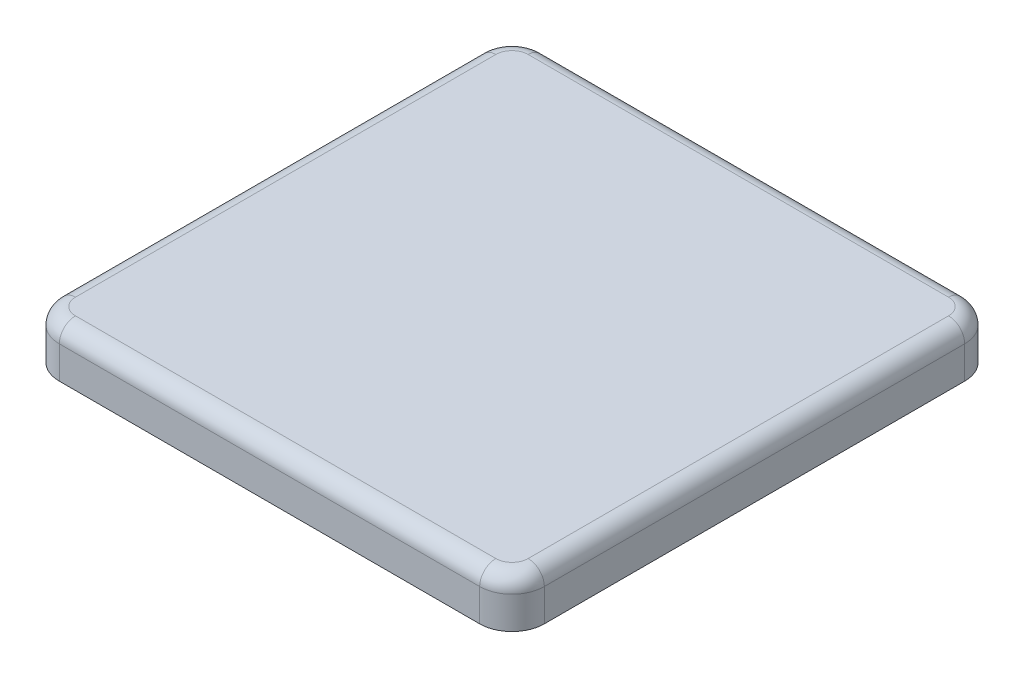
ISO-10303-21;
HEADER;
FILE_DESCRIPTION(('STEP AP214'),'2;1');
FILE_NAME('part.step','',(''),(''),'','','');
FILE_SCHEMA(('AUTOMOTIVE_DESIGN { 1 0 10303 214 1 1 1 1 }'));
ENDSEC;
DATA;
#1=APPLICATION_CONTEXT('core data for automotive mechanical design processes');
#2=APPLICATION_PROTOCOL_DEFINITION('international standard','automotive_design',2000,#1);
#3=PRODUCT_CONTEXT('',#1,'mechanical');
#4=PRODUCT('Part','Part','',(#3));
#5=PRODUCT_RELATED_PRODUCT_CATEGORY('part','',(#4));
#6=PRODUCT_DEFINITION_FORMATION('','',#4);
#7=PRODUCT_DEFINITION_CONTEXT('part definition',#1,'design');
#8=PRODUCT_DEFINITION('design','',#6,#7);
#9=PRODUCT_DEFINITION_SHAPE('','',#8);
#10=(LENGTH_UNIT() NAMED_UNIT(*) SI_UNIT(.MILLI.,.METRE.));
#11=(NAMED_UNIT(*) PLANE_ANGLE_UNIT() SI_UNIT($,.RADIAN.));
#12=(NAMED_UNIT(*) SI_UNIT($,.STERADIAN.) SOLID_ANGLE_UNIT());
#13=UNCERTAINTY_MEASURE_WITH_UNIT(LENGTH_MEASURE(1.E-05),#10,'distance_accuracy_value','');
#14=(GEOMETRIC_REPRESENTATION_CONTEXT(3) GLOBAL_UNCERTAINTY_ASSIGNED_CONTEXT((#13)) GLOBAL_UNIT_ASSIGNED_CONTEXT((#10,
#11,#12)) REPRESENTATION_CONTEXT('',''));
#15=CARTESIAN_POINT('',(0.,0.,0.));
#16=DIRECTION('',(0.,0.,1.));
#17=DIRECTION('',(1.,0.,0.));
#18=AXIS2_PLACEMENT_3D('',#15,#16,#17);
#19=CARTESIAN_POINT('',(-13.,-0.5,13.));
#20=DIRECTION('',(0.,-1.,0.));
#21=DIRECTION('',(0.,0.,-1.));
#22=AXIS2_PLACEMENT_3D('',#19,#20,#21);
#23=PLANE('',#22);
#24=DIRECTION('',(0.,0.,1.));
#25=VECTOR('',#24,1.);
#26=CARTESIAN_POINT('',(-12.1,-0.5,3.));
#27=LINE('',#26,#25);
#28=CARTESIAN_POINT('',(-12.1,-0.5,-3.));
#29=VERTEX_POINT('',#28);
#30=CARTESIAN_POINT('',(-12.1,-0.5,3.));
#31=VERTEX_POINT('',#30);
#32=EDGE_CURVE('E251',#29,#31,#27,.T.);
#33=ORIENTED_EDGE('',*,*,#32,.F.);
#34=DIRECTION('',(-1.,0.,0.));
#35=VECTOR('',#34,1.);
#36=CARTESIAN_POINT('',(-13.,-0.5,-3.));
#37=LINE('',#36,#35);
#38=CARTESIAN_POINT('',(-13.2,-0.5,-3.));
#39=VERTEX_POINT('',#38);
#40=EDGE_CURVE('E449',#29,#39,#37,.T.);
#41=ORIENTED_EDGE('',*,*,#40,.T.);
#42=DIRECTION('',(0.,0.,-1.));
#43=VECTOR('',#42,1.);
#44=CARTESIAN_POINT('',(-13.2,-0.5,13.));
#45=LINE('',#44,#43);
#46=CARTESIAN_POINT('',(-13.2,-0.5,-13.));
#47=VERTEX_POINT('',#46);
#48=EDGE_CURVE('E310',#39,#47,#45,.T.);
#49=ORIENTED_EDGE('',*,*,#48,.T.);
#50=CARTESIAN_POINT('',(-13.,-0.5,-13.));
#51=DIRECTION('',(0.,-1.,0.));
#52=DIRECTION('',(0.,0.,-1.));
#53=AXIS2_PLACEMENT_3D('',#50,#51,#52);
#54=CIRCLE('',#53,0.200000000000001);
#55=CARTESIAN_POINT('',(-13.,-0.5,-13.2));
#56=VERTEX_POINT('',#55);
#57=EDGE_CURVE('E315',#47,#56,#54,.T.);
#58=ORIENTED_EDGE('',*,*,#57,.T.);
#59=DIRECTION('',(1.,0.,0.));
#60=VECTOR('',#59,1.);
#61=CARTESIAN_POINT('',(-13.,-0.5,-13.2));
#62=LINE('',#61,#60);
#63=CARTESIAN_POINT('',(13.,-0.5,-13.2));
#64=VERTEX_POINT('',#63);
#65=EDGE_CURVE('E318',#56,#64,#62,.T.);
#66=ORIENTED_EDGE('',*,*,#65,.T.);
#67=CARTESIAN_POINT('',(13.,-0.5,-13.));
#68=DIRECTION('',(0.,-1.,0.));
#69=DIRECTION('',(0.,0.,-1.));
#70=AXIS2_PLACEMENT_3D('',#67,#68,#69);
#71=CIRCLE('',#70,0.200000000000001);
#72=CARTESIAN_POINT('',(13.2,-0.5,-13.));
#73=VERTEX_POINT('',#72);
#74=EDGE_CURVE('E321',#64,#73,#71,.T.);
#75=ORIENTED_EDGE('',*,*,#74,.T.);
#76=DIRECTION('',(0.,0.,1.));
#77=VECTOR('',#76,1.);
#78=CARTESIAN_POINT('',(13.2,-0.5,13.));
#79=LINE('',#78,#77);
#80=CARTESIAN_POINT('',(13.2,-0.5,13.));
#81=VERTEX_POINT('',#80);
#82=EDGE_CURVE('E324',#73,#81,#79,.T.);
#83=ORIENTED_EDGE('',*,*,#82,.T.);
#84=CARTESIAN_POINT('',(13.,-0.5,13.));
#85=DIRECTION('',(0.,-1.,0.));
#86=DIRECTION('',(0.,0.,-1.));
#87=AXIS2_PLACEMENT_3D('',#84,#85,#86);
#88=CIRCLE('',#87,0.200000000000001);
#89=CARTESIAN_POINT('',(13.,-0.5,13.2));
#90=VERTEX_POINT('',#89);
#91=EDGE_CURVE('E327',#81,#90,#88,.T.);
#92=ORIENTED_EDGE('',*,*,#91,.T.);
#93=DIRECTION('',(-1.,0.,0.));
#94=VECTOR('',#93,1.);
#95=CARTESIAN_POINT('',(-13.,-0.5,13.2));
#96=LINE('',#95,#94);
#97=CARTESIAN_POINT('',(-13.,-0.5,13.2));
#98=VERTEX_POINT('',#97);
#99=EDGE_CURVE('E330',#90,#98,#96,.T.);
#100=ORIENTED_EDGE('',*,*,#99,.T.);
#101=CARTESIAN_POINT('',(-13.,-0.5,13.));
#102=DIRECTION('',(0.,-1.,0.));
#103=DIRECTION('',(0.,0.,-1.));
#104=AXIS2_PLACEMENT_3D('',#101,#102,#103);
#105=CIRCLE('',#104,0.200000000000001);
#106=CARTESIAN_POINT('',(-13.2,-0.5,13.));
#107=VERTEX_POINT('',#106);
#108=EDGE_CURVE('E307',#98,#107,#105,.T.);
#109=ORIENTED_EDGE('',*,*,#108,.T.);
#110=CARTESIAN_POINT('',(-13.2,-0.5,3.));
#111=VERTEX_POINT('',#110);
#112=EDGE_CURVE('E312',#107,#111,#45,.T.);
#113=ORIENTED_EDGE('',*,*,#112,.T.);
#114=DIRECTION('',(-1.,0.,0.));
#115=VECTOR('',#114,1.);
#116=CARTESIAN_POINT('',(-13.7,-0.5,3.));
#117=LINE('',#116,#115);
#118=EDGE_CURVE('E278',#31,#111,#117,.T.);
#119=ORIENTED_EDGE('',*,*,#118,.F.);
#120=EDGE_LOOP('',(#33,#41,#49,#58,#66,#75,#83,#92,#100,#109,#113,#119));
#121=FACE_BOUND('',#120,.T.);
#122=DIRECTION('',(1.,0.,0.));
#123=VECTOR('',#122,1.);
#124=CARTESIAN_POINT('',(-1.65,-0.5,-2.45));
#125=LINE('',#124,#123);
#126=CARTESIAN_POINT('',(-1.65,-0.5,-2.45));
#127=VERTEX_POINT('',#126);
#128=CARTESIAN_POINT('',(1.65,-0.5,-2.45));
#129=VERTEX_POINT('',#128);
#130=EDGE_CURVE('E247',#127,#129,#125,.T.);
#131=ORIENTED_EDGE('',*,*,#130,.F.);
#132=DIRECTION('',(0.,0.,-1.));
#133=VECTOR('',#132,1.);
#134=CARTESIAN_POINT('',(-1.65,-0.5,2.45));
#135=LINE('',#134,#133);
#136=CARTESIAN_POINT('',(-1.65,-0.5,2.45));
#137=VERTEX_POINT('',#136);
#138=EDGE_CURVE('E255',#137,#127,#135,.T.);
#139=ORIENTED_EDGE('',*,*,#138,.F.);
#140=DIRECTION('',(-1.,0.,0.));
#141=VECTOR('',#140,1.);
#142=CARTESIAN_POINT('',(-1.65,-0.5,2.45));
#143=LINE('',#142,#141);
#144=CARTESIAN_POINT('',(1.65,-0.5,2.45));
#145=VERTEX_POINT('',#144);
#146=EDGE_CURVE('E266',#145,#137,#143,.T.);
#147=ORIENTED_EDGE('',*,*,#146,.F.);
#148=DIRECTION('',(0.,0.,1.));
#149=VECTOR('',#148,1.);
#150=CARTESIAN_POINT('',(1.65,-0.5,2.45));
#151=LINE('',#150,#149);
#152=EDGE_CURVE('E264',#129,#145,#151,.T.);
#153=ORIENTED_EDGE('',*,*,#152,.F.);
#154=EDGE_LOOP('',(#131,#139,#147,#153));
#155=FACE_BOUND('',#154,.T.);
#156=ADVANCED_FACE('F35',(#121,#155),#23,.T.);
#157=CARTESIAN_POINT('',(-13.,-1.5,-13.));
#158=DIRECTION('',(0.,1.,0.));
#159=DIRECTION('',(0.,0.,1.));
#160=AXIS2_PLACEMENT_3D('',#157,#158,#159);
#161=PLANE('',#160);
#162=CARTESIAN_POINT('',(-13.,-1.5,-13.));
#163=DIRECTION('',(0.,1.,0.));
#164=DIRECTION('',(0.,0.,1.));
#165=AXIS2_PLACEMENT_3D('',#162,#163,#164);
#166=CIRCLE('',#165,2.);
#167=CARTESIAN_POINT('',(-13.,-1.5,-15.));
#168=VERTEX_POINT('',#167);
#169=CARTESIAN_POINT('',(-15.,-1.5,-13.));
#170=VERTEX_POINT('',#169);
#171=EDGE_CURVE('E374',#168,#170,#166,.T.);
#172=ORIENTED_EDGE('',*,*,#171,.F.);
#173=DIRECTION('',(-1.,0.,0.));
#174=VECTOR('',#173,1.);
#175=CARTESIAN_POINT('',(-13.,-1.5,-15.));
#176=LINE('',#175,#174);
#177=CARTESIAN_POINT('',(13.,-1.5,-15.));
#178=VERTEX_POINT('',#177);
#179=EDGE_CURVE('E396',#178,#168,#176,.T.);
#180=ORIENTED_EDGE('',*,*,#179,.F.);
#181=CARTESIAN_POINT('',(13.,-1.5,-13.));
#182=DIRECTION('',(0.,1.,0.));
#183=DIRECTION('',(0.,0.,1.));
#184=AXIS2_PLACEMENT_3D('',#181,#182,#183);
#185=CIRCLE('',#184,2.);
#186=CARTESIAN_POINT('',(15.,-1.5,-13.));
#187=VERTEX_POINT('',#186);
#188=EDGE_CURVE('E393',#187,#178,#185,.T.);
#189=ORIENTED_EDGE('',*,*,#188,.F.);
#190=DIRECTION('',(0.,0.,-1.));
#191=VECTOR('',#190,1.);
#192=CARTESIAN_POINT('',(15.,-1.5,13.));
#193=LINE('',#192,#191);
#194=CARTESIAN_POINT('',(15.,-1.5,13.));
#195=VERTEX_POINT('',#194);
#196=EDGE_CURVE('E390',#195,#187,#193,.T.);
#197=ORIENTED_EDGE('',*,*,#196,.F.);
#198=CARTESIAN_POINT('',(13.,-1.5,13.));
#199=DIRECTION('',(0.,1.,0.));
#200=DIRECTION('',(0.,0.,1.));
#201=AXIS2_PLACEMENT_3D('',#198,#199,#200);
#202=CIRCLE('',#201,2.);
#203=CARTESIAN_POINT('',(13.,-1.5,15.));
#204=VERTEX_POINT('',#203);
#205=EDGE_CURVE('E387',#204,#195,#202,.T.);
#206=ORIENTED_EDGE('',*,*,#205,.F.);
#207=DIRECTION('',(1.,0.,0.));
#208=VECTOR('',#207,1.);
#209=CARTESIAN_POINT('',(-13.,-1.5,15.));
#210=LINE('',#209,#208);
#211=CARTESIAN_POINT('',(-13.,-1.5,15.));
#212=VERTEX_POINT('',#211);
#213=EDGE_CURVE('E384',#212,#204,#210,.T.);
#214=ORIENTED_EDGE('',*,*,#213,.F.);
#215=CARTESIAN_POINT('',(-13.,-1.5,13.));
#216=DIRECTION('',(0.,1.,0.));
#217=DIRECTION('',(0.,0.,1.));
#218=AXIS2_PLACEMENT_3D('',#215,#216,#217);
#219=CIRCLE('',#218,2.);
#220=CARTESIAN_POINT('',(-15.,-1.5,13.));
#221=VERTEX_POINT('',#220);
#222=EDGE_CURVE('E381',#221,#212,#219,.T.);
#223=ORIENTED_EDGE('',*,*,#222,.F.);
#224=DIRECTION('',(0.,0.,1.));
#225=VECTOR('',#224,1.);
#226=CARTESIAN_POINT('',(-15.,-1.5,13.));
#227=LINE('',#226,#225);
#228=EDGE_CURVE('E377',#170,#221,#227,.T.);
#229=ORIENTED_EDGE('',*,*,#228,.F.);
#230=EDGE_LOOP('',(#172,#180,#189,#197,#206,#214,#223,#229));
#231=FACE_BOUND('',#230,.T.);
#232=DIRECTION('',(1.,0.,0.));
#233=VECTOR('',#232,1.);
#234=CARTESIAN_POINT('',(-13.,-1.5,-3.));
#235=LINE('',#234,#233);
#236=CARTESIAN_POINT('',(-13.7,-1.5,-3.));
#237=VERTEX_POINT('',#236);
#238=CARTESIAN_POINT('',(-13.2,-1.5,-3.));
#239=VERTEX_POINT('',#238);
#240=EDGE_CURVE('E304',#237,#239,#235,.T.);
#241=ORIENTED_EDGE('',*,*,#240,.F.);
#242=DIRECTION('',(0.,0.,-1.));
#243=VECTOR('',#242,1.);
#244=CARTESIAN_POINT('',(-13.7,-1.5,-13.));
#245=LINE('',#244,#243);
#246=CARTESIAN_POINT('',(-13.7,-1.5,3.));
#247=VERTEX_POINT('',#246);
#248=EDGE_CURVE('E472',#247,#237,#245,.T.);
#249=ORIENTED_EDGE('',*,*,#248,.F.);
#250=DIRECTION('',(-1.,0.,0.));
#251=VECTOR('',#250,1.);
#252=CARTESIAN_POINT('',(-13.,-1.5,3.));
#253=LINE('',#252,#251);
#254=CARTESIAN_POINT('',(-13.2,-1.5,3.));
#255=VERTEX_POINT('',#254);
#256=EDGE_CURVE('E300',#255,#247,#253,.T.);
#257=ORIENTED_EDGE('',*,*,#256,.F.);
#258=DIRECTION('',(0.,0.,-1.));
#259=VECTOR('',#258,1.);
#260=CARTESIAN_POINT('',(-13.2,-1.5,13.));
#261=LINE('',#260,#259);
#262=CARTESIAN_POINT('',(-13.2,-1.5,13.));
#263=VERTEX_POINT('',#262);
#264=EDGE_CURVE('E336',#263,#255,#261,.T.);
#265=ORIENTED_EDGE('',*,*,#264,.F.);
#266=CARTESIAN_POINT('',(-13.,-1.5,13.));
#267=DIRECTION('',(0.,-1.,0.));
#268=DIRECTION('',(0.,0.,-1.));
#269=AXIS2_PLACEMENT_3D('',#266,#267,#268);
#270=CIRCLE('',#269,0.200000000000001);
#271=CARTESIAN_POINT('',(-13.,-1.5,13.2));
#272=VERTEX_POINT('',#271);
#273=EDGE_CURVE('E306',#272,#263,#270,.T.);
#274=ORIENTED_EDGE('',*,*,#273,.F.);
#275=DIRECTION('',(-1.,0.,0.));
#276=VECTOR('',#275,1.);
#277=CARTESIAN_POINT('',(-13.,-1.5,13.2));
#278=LINE('',#277,#276);
#279=CARTESIAN_POINT('',(13.,-1.5,13.2));
#280=VERTEX_POINT('',#279);
#281=EDGE_CURVE('E311',#280,#272,#278,.T.);
#282=ORIENTED_EDGE('',*,*,#281,.F.);
#283=CARTESIAN_POINT('',(13.,-1.5,13.));
#284=DIRECTION('',(0.,-1.,0.));
#285=DIRECTION('',(0.,0.,-1.));
#286=AXIS2_PLACEMENT_3D('',#283,#284,#285);
#287=CIRCLE('',#286,0.200000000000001);
#288=CARTESIAN_POINT('',(13.2,-1.5,13.));
#289=VERTEX_POINT('',#288);
#290=EDGE_CURVE('E351',#289,#280,#287,.T.);
#291=ORIENTED_EDGE('',*,*,#290,.F.);
#292=DIRECTION('',(0.,0.,1.));
#293=VECTOR('',#292,1.);
#294=CARTESIAN_POINT('',(13.2,-1.5,13.));
#295=LINE('',#294,#293);
#296=CARTESIAN_POINT('',(13.2,-1.5,-13.));
#297=VERTEX_POINT('',#296);
#298=EDGE_CURVE('E348',#297,#289,#295,.T.);
#299=ORIENTED_EDGE('',*,*,#298,.F.);
#300=CARTESIAN_POINT('',(13.,-1.5,-13.));
#301=DIRECTION('',(0.,-1.,0.));
#302=DIRECTION('',(0.,0.,-1.));
#303=AXIS2_PLACEMENT_3D('',#300,#301,#302);
#304=CIRCLE('',#303,0.200000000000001);
#305=CARTESIAN_POINT('',(13.,-1.5,-13.2));
#306=VERTEX_POINT('',#305);
#307=EDGE_CURVE('E345',#306,#297,#304,.T.);
#308=ORIENTED_EDGE('',*,*,#307,.F.);
#309=DIRECTION('',(1.,0.,0.));
#310=VECTOR('',#309,1.);
#311=CARTESIAN_POINT('',(-13.,-1.5,-13.2));
#312=LINE('',#311,#310);
#313=CARTESIAN_POINT('',(-13.,-1.5,-13.2));
#314=VERTEX_POINT('',#313);
#315=EDGE_CURVE('E342',#314,#306,#312,.T.);
#316=ORIENTED_EDGE('',*,*,#315,.F.);
#317=CARTESIAN_POINT('',(-13.,-1.5,-13.));
#318=DIRECTION('',(0.,-1.,0.));
#319=DIRECTION('',(0.,0.,-1.));
#320=AXIS2_PLACEMENT_3D('',#317,#318,#319);
#321=CIRCLE('',#320,0.200000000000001);
#322=CARTESIAN_POINT('',(-13.2,-1.5,-13.));
#323=VERTEX_POINT('',#322);
#324=EDGE_CURVE('E339',#323,#314,#321,.T.);
#325=ORIENTED_EDGE('',*,*,#324,.F.);
#326=EDGE_CURVE('E335',#239,#323,#261,.T.);
#327=ORIENTED_EDGE('',*,*,#326,.F.);
#328=EDGE_LOOP('',(#241,#249,#257,#265,#274,#282,#291,#299,#308,#316,#325,#327));
#329=FACE_BOUND('',#328,.T.);
#330=ADVANCED_FACE('F524',(#231,#329),#161,.F.);
#331=CARTESIAN_POINT('',(-13.2,-0.5,13.));
#332=DIRECTION('',(-1.,0.,0.));
#333=DIRECTION('',(0.,0.,1.));
#334=AXIS2_PLACEMENT_3D('',#331,#332,#333);
#335=PLANE('',#334);
#336=DIRECTION('',(0.,1.,0.));
#337=VECTOR('',#336,1.);
#338=CARTESIAN_POINT('',(-13.2,-0.5,-3.));
#339=LINE('',#338,#337);
#340=EDGE_CURVE('E302',#239,#39,#339,.T.);
#341=ORIENTED_EDGE('',*,*,#340,.F.);
#342=ORIENTED_EDGE('',*,*,#326,.T.);
#343=DIRECTION('',(0.,-1.,0.));
#344=VECTOR('',#343,1.);
#345=CARTESIAN_POINT('',(-13.2,-0.5,-13.));
#346=LINE('',#345,#344);
#347=EDGE_CURVE('E369',#47,#323,#346,.T.);
#348=ORIENTED_EDGE('',*,*,#347,.F.);
#349=ORIENTED_EDGE('',*,*,#48,.F.);
#350=EDGE_LOOP('',(#341,#342,#348,#349));
#351=FACE_BOUND('',#350,.T.);
#352=ADVANCED_FACE('F530',(#351),#335,.F.);
#353=DIRECTION('',(0.,-1.,0.));
#354=VECTOR('',#353,1.);
#355=CARTESIAN_POINT('',(-13.2,-0.5,3.));
#356=LINE('',#355,#354);
#357=EDGE_CURVE('E298',#111,#255,#356,.T.);
#358=ORIENTED_EDGE('',*,*,#357,.F.);
#359=ORIENTED_EDGE('',*,*,#112,.F.);
#360=DIRECTION('',(0.,-1.,0.));
#361=VECTOR('',#360,1.);
#362=CARTESIAN_POINT('',(-13.2,-0.5,13.));
#363=LINE('',#362,#361);
#364=EDGE_CURVE('E333',#107,#263,#363,.T.);
#365=ORIENTED_EDGE('',*,*,#364,.T.);
#366=ORIENTED_EDGE('',*,*,#264,.T.);
#367=EDGE_LOOP('',(#358,#359,#365,#366));
#368=FACE_BOUND('',#367,.T.);
#369=ADVANCED_FACE('F565',(#368),#335,.F.);
#370=CARTESIAN_POINT('',(-13.,1.5,-13.));
#371=DIRECTION('',(0.,-1.,0.));
#372=DIRECTION('',(0.,0.,-1.));
#373=AXIS2_PLACEMENT_3D('',#370,#371,#372);
#374=CYLINDRICAL_SURFACE('',#373,2.);
#375=DIRECTION('',(0.,-1.,0.));
#376=VECTOR('',#375,1.);
#377=CARTESIAN_POINT('',(-15.,1.5,-13.));
#378=LINE('',#377,#376);
#379=CARTESIAN_POINT('',(-15.,0.5,-13.));
#380=VERTEX_POINT('',#379);
#381=EDGE_CURVE('E413',#380,#170,#378,.T.);
#382=ORIENTED_EDGE('',*,*,#381,.F.);
#383=CARTESIAN_POINT('',(-13.,0.5,-13.));
#384=DIRECTION('',(0.,1.,0.));
#385=DIRECTION('',(0.,0.,1.));
#386=AXIS2_PLACEMENT_3D('',#383,#384,#385);
#387=CIRCLE('',#386,2.);
#388=CARTESIAN_POINT('',(-13.,0.5,-15.));
#389=VERTEX_POINT('',#388);
#390=EDGE_CURVE('E437',#380,#389,#387,.F.);
#391=ORIENTED_EDGE('',*,*,#390,.T.);
#392=DIRECTION('',(0.,-1.,0.));
#393=VECTOR('',#392,1.);
#394=CARTESIAN_POINT('',(-13.,1.5,-15.));
#395=LINE('',#394,#393);
#396=EDGE_CURVE('E399',#389,#168,#395,.T.);
#397=ORIENTED_EDGE('',*,*,#396,.T.);
#398=ORIENTED_EDGE('',*,*,#171,.T.);
#399=EDGE_LOOP('',(#382,#391,#397,#398));
#400=FACE_BOUND('',#399,.T.);
#401=ADVANCED_FACE('F603',(#400),#374,.T.);
#402=CARTESIAN_POINT('',(-15.,1.5,13.));
#403=DIRECTION('',(1.,0.,0.));
#404=DIRECTION('',(0.,0.,-1.));
#405=AXIS2_PLACEMENT_3D('',#402,#403,#404);
#406=PLANE('',#405);
#407=DIRECTION('',(0.,-1.,0.));
#408=VECTOR('',#407,1.);
#409=CARTESIAN_POINT('',(-15.,1.5,13.));
#410=LINE('',#409,#408);
#411=CARTESIAN_POINT('',(-15.,0.5,13.));
#412=VERTEX_POINT('',#411);
#413=EDGE_CURVE('E411',#412,#221,#410,.T.);
#414=ORIENTED_EDGE('',*,*,#413,.F.);
#415=DIRECTION('',(0.,0.,1.));
#416=VECTOR('',#415,1.);
#417=CARTESIAN_POINT('',(-15.,0.5,-13.));
#418=LINE('',#417,#416);
#419=EDGE_CURVE('E435',#412,#380,#418,.F.);
#420=ORIENTED_EDGE('',*,*,#419,.T.);
#421=ORIENTED_EDGE('',*,*,#381,.T.);
#422=ORIENTED_EDGE('',*,*,#228,.T.);
#423=EDGE_LOOP('',(#414,#420,#421,#422));
#424=FACE_BOUND('',#423,.T.);
#425=ADVANCED_FACE('F599',(#424),#406,.F.);
#426=CARTESIAN_POINT('',(-13.,1.5,13.));
#427=DIRECTION('',(0.,-1.,0.));
#428=DIRECTION('',(0.,0.,-1.));
#429=AXIS2_PLACEMENT_3D('',#426,#427,#428);
#430=CYLINDRICAL_SURFACE('',#429,2.);
#431=DIRECTION('',(0.,-1.,0.));
#432=VECTOR('',#431,1.);
#433=CARTESIAN_POINT('',(-13.,1.5,15.));
#434=LINE('',#433,#432);
#435=CARTESIAN_POINT('',(-13.,0.5,15.));
#436=VERTEX_POINT('',#435);
#437=EDGE_CURVE('E409',#436,#212,#434,.T.);
#438=ORIENTED_EDGE('',*,*,#437,.F.);
#439=CARTESIAN_POINT('',(-13.,0.5,13.));
#440=DIRECTION('',(0.,1.,0.));
#441=DIRECTION('',(0.,0.,1.));
#442=AXIS2_PLACEMENT_3D('',#439,#440,#441);
#443=CIRCLE('',#442,2.);
#444=EDGE_CURVE('E432',#436,#412,#443,.F.);
#445=ORIENTED_EDGE('',*,*,#444,.T.);
#446=ORIENTED_EDGE('',*,*,#413,.T.);
#447=ORIENTED_EDGE('',*,*,#222,.T.);
#448=EDGE_LOOP('',(#438,#445,#446,#447));
#449=FACE_BOUND('',#448,.T.);
#450=ADVANCED_FACE('F595',(#449),#430,.T.);
#451=CARTESIAN_POINT('',(-13.,1.5,15.));
#452=DIRECTION('',(0.,0.,-1.));
#453=DIRECTION('',(-1.,0.,0.));
#454=AXIS2_PLACEMENT_3D('',#451,#452,#453);
#455=PLANE('',#454);
#456=DIRECTION('',(0.,-1.,0.));
#457=VECTOR('',#456,1.);
#458=CARTESIAN_POINT('',(13.,1.5,15.));
#459=LINE('',#458,#457);
#460=CARTESIAN_POINT('',(13.,0.5,15.));
#461=VERTEX_POINT('',#460);
#462=EDGE_CURVE('E407',#461,#204,#459,.T.);
#463=ORIENTED_EDGE('',*,*,#462,.F.);
#464=DIRECTION('',(1.,0.,0.));
#465=VECTOR('',#464,1.);
#466=CARTESIAN_POINT('',(-13.,0.5,15.));
#467=LINE('',#466,#465);
#468=EDGE_CURVE('E447',#461,#436,#467,.F.);
#469=ORIENTED_EDGE('',*,*,#468,.T.);
#470=ORIENTED_EDGE('',*,*,#437,.T.);
#471=ORIENTED_EDGE('',*,*,#213,.T.);
#472=EDGE_LOOP('',(#463,#469,#470,#471));
#473=FACE_BOUND('',#472,.T.);
#474=ADVANCED_FACE('F591',(#473),#455,.F.);
#475=CARTESIAN_POINT('',(13.,1.5,13.));
#476=DIRECTION('',(0.,-1.,0.));
#477=DIRECTION('',(0.,0.,-1.));
#478=AXIS2_PLACEMENT_3D('',#475,#476,#477);
#479=CYLINDRICAL_SURFACE('',#478,2.);
#480=DIRECTION('',(0.,-1.,0.));
#481=VECTOR('',#480,1.);
#482=CARTESIAN_POINT('',(15.,1.5,13.));
#483=LINE('',#482,#481);
#484=CARTESIAN_POINT('',(15.,0.5,13.));
#485=VERTEX_POINT('',#484);
#486=EDGE_CURVE('E405',#485,#195,#483,.T.);
#487=ORIENTED_EDGE('',*,*,#486,.F.);
#488=CARTESIAN_POINT('',(13.,0.5,13.));
#489=DIRECTION('',(0.,1.,0.));
#490=DIRECTION('',(0.,0.,1.));
#491=AXIS2_PLACEMENT_3D('',#488,#489,#490);
#492=CIRCLE('',#491,2.);
#493=EDGE_CURVE('E445',#485,#461,#492,.F.);
#494=ORIENTED_EDGE('',*,*,#493,.T.);
#495=ORIENTED_EDGE('',*,*,#462,.T.);
#496=ORIENTED_EDGE('',*,*,#205,.T.);
#497=EDGE_LOOP('',(#487,#494,#495,#496));
#498=FACE_BOUND('',#497,.T.);
#499=ADVANCED_FACE('F587',(#498),#479,.T.);
#500=CARTESIAN_POINT('',(15.,1.5,13.));
#501=DIRECTION('',(-1.,0.,0.));
#502=DIRECTION('',(0.,0.,1.));
#503=AXIS2_PLACEMENT_3D('',#500,#501,#502);
#504=PLANE('',#503);
#505=DIRECTION('',(0.,-1.,0.));
#506=VECTOR('',#505,1.);
#507=CARTESIAN_POINT('',(15.,1.5,-13.));
#508=LINE('',#507,#506);
#509=CARTESIAN_POINT('',(15.,0.5,-13.));
#510=VERTEX_POINT('',#509);
#511=EDGE_CURVE('E403',#510,#187,#508,.T.);
#512=ORIENTED_EDGE('',*,*,#511,.F.);
#513=DIRECTION('',(0.,0.,-1.));
#514=VECTOR('',#513,1.);
#515=CARTESIAN_POINT('',(15.,0.5,13.));
#516=LINE('',#515,#514);
#517=EDGE_CURVE('E443',#510,#485,#516,.F.);
#518=ORIENTED_EDGE('',*,*,#517,.T.);
#519=ORIENTED_EDGE('',*,*,#486,.T.);
#520=ORIENTED_EDGE('',*,*,#196,.T.);
#521=EDGE_LOOP('',(#512,#518,#519,#520));
#522=FACE_BOUND('',#521,.T.);
#523=ADVANCED_FACE('F583',(#522),#504,.F.);
#524=CARTESIAN_POINT('',(13.,1.5,-13.));
#525=DIRECTION('',(0.,-1.,0.));
#526=DIRECTION('',(0.,0.,-1.));
#527=AXIS2_PLACEMENT_3D('',#524,#525,#526);
#528=CYLINDRICAL_SURFACE('',#527,2.);
#529=DIRECTION('',(0.,-1.,0.));
#530=VECTOR('',#529,1.);
#531=CARTESIAN_POINT('',(13.,1.5,-15.));
#532=LINE('',#531,#530);
#533=CARTESIAN_POINT('',(13.,0.5,-15.));
#534=VERTEX_POINT('',#533);
#535=EDGE_CURVE('E401',#534,#178,#532,.T.);
#536=ORIENTED_EDGE('',*,*,#535,.F.);
#537=CARTESIAN_POINT('',(13.,0.5,-13.));
#538=DIRECTION('',(0.,1.,0.));
#539=DIRECTION('',(0.,0.,1.));
#540=AXIS2_PLACEMENT_3D('',#537,#538,#539);
#541=CIRCLE('',#540,2.);
#542=EDGE_CURVE('E441',#534,#510,#541,.F.);
#543=ORIENTED_EDGE('',*,*,#542,.T.);
#544=ORIENTED_EDGE('',*,*,#511,.T.);
#545=ORIENTED_EDGE('',*,*,#188,.T.);
#546=EDGE_LOOP('',(#536,#543,#544,#545));
#547=FACE_BOUND('',#546,.T.);
#548=ADVANCED_FACE('F579',(#547),#528,.T.);
#549=CARTESIAN_POINT('',(-13.,1.5,-15.));
#550=DIRECTION('',(0.,0.,1.));
#551=DIRECTION('',(1.,0.,0.));
#552=AXIS2_PLACEMENT_3D('',#549,#550,#551);
#553=PLANE('',#552);
#554=ORIENTED_EDGE('',*,*,#396,.F.);
#555=DIRECTION('',(-1.,0.,0.));
#556=VECTOR('',#555,1.);
#557=CARTESIAN_POINT('',(13.,0.5,-15.));
#558=LINE('',#557,#556);
#559=EDGE_CURVE('E439',#389,#534,#558,.F.);
#560=ORIENTED_EDGE('',*,*,#559,.T.);
#561=ORIENTED_EDGE('',*,*,#535,.T.);
#562=ORIENTED_EDGE('',*,*,#179,.T.);
#563=EDGE_LOOP('',(#554,#560,#561,#562));
#564=FACE_BOUND('',#563,.T.);
#565=ADVANCED_FACE('F574',(#564),#553,.F.);
#566=CARTESIAN_POINT('',(-13.,1.5,-13.));
#567=DIRECTION('',(0.,1.,0.));
#568=DIRECTION('',(0.,0.,1.));
#569=AXIS2_PLACEMENT_3D('',#566,#567,#568);
#570=PLANE('',#569);
#571=DIRECTION('',(0.,0.,1.));
#572=VECTOR('',#571,1.);
#573=CARTESIAN_POINT('',(-14.,1.5,13.));
#574=LINE('',#573,#572);
#575=CARTESIAN_POINT('',(-14.,1.5,-13.));
#576=VERTEX_POINT('',#575);
#577=CARTESIAN_POINT('',(-14.,1.5,13.));
#578=VERTEX_POINT('',#577);
#579=EDGE_CURVE('E427',#576,#578,#574,.T.);
#580=ORIENTED_EDGE('',*,*,#579,.T.);
#581=CARTESIAN_POINT('',(-13.,1.5,13.));
#582=DIRECTION('',(0.,1.,0.));
#583=DIRECTION('',(0.,0.,1.));
#584=AXIS2_PLACEMENT_3D('',#581,#582,#583);
#585=CIRCLE('',#584,1.);
#586=CARTESIAN_POINT('',(-13.,1.5,14.));
#587=VERTEX_POINT('',#586);
#588=EDGE_CURVE('E429',#578,#587,#585,.T.);
#589=ORIENTED_EDGE('',*,*,#588,.T.);
#590=DIRECTION('',(1.,0.,0.));
#591=VECTOR('',#590,1.);
#592=CARTESIAN_POINT('',(13.,1.5,14.));
#593=LINE('',#592,#591);
#594=CARTESIAN_POINT('',(13.,1.5,14.));
#595=VERTEX_POINT('',#594);
#596=EDGE_CURVE('E415',#587,#595,#593,.T.);
#597=ORIENTED_EDGE('',*,*,#596,.T.);
#598=CARTESIAN_POINT('',(13.,1.5,13.));
#599=DIRECTION('',(0.,1.,0.));
#600=DIRECTION('',(0.,0.,1.));
#601=AXIS2_PLACEMENT_3D('',#598,#599,#600);
#602=CIRCLE('',#601,1.);
#603=CARTESIAN_POINT('',(14.,1.5,13.));
#604=VERTEX_POINT('',#603);
#605=EDGE_CURVE('E417',#595,#604,#602,.T.);
#606=ORIENTED_EDGE('',*,*,#605,.T.);
#607=DIRECTION('',(0.,0.,-1.));
#608=VECTOR('',#607,1.);
#609=CARTESIAN_POINT('',(14.,1.5,-13.));
#610=LINE('',#609,#608);
#611=CARTESIAN_POINT('',(14.,1.5,-13.));
#612=VERTEX_POINT('',#611);
#613=EDGE_CURVE('E419',#604,#612,#610,.T.);
#614=ORIENTED_EDGE('',*,*,#613,.T.);
#615=CARTESIAN_POINT('',(13.,1.5,-13.));
#616=DIRECTION('',(0.,1.,0.));
#617=DIRECTION('',(0.,0.,1.));
#618=AXIS2_PLACEMENT_3D('',#615,#616,#617);
#619=CIRCLE('',#618,1.);
#620=CARTESIAN_POINT('',(13.,1.5,-14.));
#621=VERTEX_POINT('',#620);
#622=EDGE_CURVE('E421',#612,#621,#619,.T.);
#623=ORIENTED_EDGE('',*,*,#622,.T.);
#624=DIRECTION('',(-1.,0.,0.));
#625=VECTOR('',#624,1.);
#626=CARTESIAN_POINT('',(-13.,1.5,-14.));
#627=LINE('',#626,#625);
#628=CARTESIAN_POINT('',(-13.,1.5,-14.));
#629=VERTEX_POINT('',#628);
#630=EDGE_CURVE('E423',#621,#629,#627,.T.);
#631=ORIENTED_EDGE('',*,*,#630,.T.);
#632=CARTESIAN_POINT('',(-13.,1.5,-13.));
#633=DIRECTION('',(0.,1.,0.));
#634=DIRECTION('',(0.,0.,1.));
#635=AXIS2_PLACEMENT_3D('',#632,#633,#634);
#636=CIRCLE('',#635,1.);
#637=EDGE_CURVE('E425',#629,#576,#636,.T.);
#638=ORIENTED_EDGE('',*,*,#637,.T.);
#639=EDGE_LOOP('',(#580,#589,#597,#606,#614,#623,#631,#638));
#640=FACE_BOUND('',#639,.T.);
#641=ADVANCED_FACE('F571',(#640),#570,.T.);
#642=CARTESIAN_POINT('',(13.,0.5,-13.));
#643=DIRECTION('',(0.,1.,0.));
#644=DIRECTION('',(0.,0.,1.));
#645=AXIS2_PLACEMENT_3D('',#642,#643,#644);
#646=DEGENERATE_TOROIDAL_SURFACE('',#645,1.,1.,.T.);
#647=CARTESIAN_POINT('',(14.,0.5,-13.));
#648=DIRECTION('',(0.,0.,1.));
#649=DIRECTION('',(1.,0.,0.));
#650=AXIS2_PLACEMENT_3D('',#647,#648,#649);
#651=CIRCLE('',#650,1.);
#652=EDGE_CURVE('E465',#510,#612,#651,.T.);
#653=ORIENTED_EDGE('',*,*,#652,.F.);
#654=ORIENTED_EDGE('',*,*,#542,.F.);
#655=CARTESIAN_POINT('',(13.,0.5,-14.));
#656=DIRECTION('',(-1.,0.,0.));
#657=DIRECTION('',(0.,0.,1.));
#658=AXIS2_PLACEMENT_3D('',#655,#656,#657);
#659=CIRCLE('',#658,1.);
#660=EDGE_CURVE('E378',#621,#534,#659,.T.);
#661=ORIENTED_EDGE('',*,*,#660,.F.);
#662=ORIENTED_EDGE('',*,*,#622,.F.);
#663=EDGE_LOOP('',(#653,#654,#661,#662));
#664=FACE_BOUND('',#663,.T.);
#665=ADVANCED_FACE('F573',(#664),#646,.T.);
#666=CARTESIAN_POINT('',(-13.,0.5,-14.));
#667=DIRECTION('',(1.,0.,0.));
#668=DIRECTION('',(0.,0.,-1.));
#669=AXIS2_PLACEMENT_3D('',#666,#667,#668);
#670=CYLINDRICAL_SURFACE('',#669,1.);
#671=ORIENTED_EDGE('',*,*,#660,.T.);
#672=ORIENTED_EDGE('',*,*,#559,.F.);
#673=CARTESIAN_POINT('',(-13.,0.5,-14.));
#674=DIRECTION('',(-1.,0.,0.));
#675=DIRECTION('',(0.,0.,1.));
#676=AXIS2_PLACEMENT_3D('',#673,#674,#675);
#677=CIRCLE('',#676,1.);
#678=EDGE_CURVE('E462',#629,#389,#677,.T.);
#679=ORIENTED_EDGE('',*,*,#678,.F.);
#680=ORIENTED_EDGE('',*,*,#630,.F.);
#681=EDGE_LOOP('',(#671,#672,#679,#680));
#682=FACE_BOUND('',#681,.T.);
#683=ADVANCED_FACE('F630',(#682),#670,.T.);
#684=CARTESIAN_POINT('',(14.,0.5,-13.));
#685=DIRECTION('',(0.,0.,1.));
#686=DIRECTION('',(1.,0.,0.));
#687=AXIS2_PLACEMENT_3D('',#684,#685,#686);
#688=CYLINDRICAL_SURFACE('',#687,1.);
#689=ORIENTED_EDGE('',*,*,#652,.T.);
#690=ORIENTED_EDGE('',*,*,#613,.F.);
#691=CARTESIAN_POINT('',(14.,0.5,13.));
#692=DIRECTION('',(0.,0.,1.));
#693=DIRECTION('',(1.,0.,0.));
#694=AXIS2_PLACEMENT_3D('',#691,#692,#693);
#695=CIRCLE('',#694,1.);
#696=EDGE_CURVE('E459',#485,#604,#695,.T.);
#697=ORIENTED_EDGE('',*,*,#696,.F.);
#698=ORIENTED_EDGE('',*,*,#517,.F.);
#699=EDGE_LOOP('',(#689,#690,#697,#698));
#700=FACE_BOUND('',#699,.T.);
#701=ADVANCED_FACE('F626',(#700),#688,.T.);
#702=CARTESIAN_POINT('',(-13.,0.5,-13.));
#703=DIRECTION('',(0.,1.,0.));
#704=DIRECTION('',(0.,0.,1.));
#705=AXIS2_PLACEMENT_3D('',#702,#703,#704);
#706=DEGENERATE_TOROIDAL_SURFACE('',#705,1.,1.,.T.);
#707=ORIENTED_EDGE('',*,*,#678,.T.);
#708=ORIENTED_EDGE('',*,*,#390,.F.);
#709=CARTESIAN_POINT('',(-14.,0.5,-13.));
#710=DIRECTION('',(0.,0.,1.));
#711=DIRECTION('',(1.,0.,0.));
#712=AXIS2_PLACEMENT_3D('',#709,#710,#711);
#713=CIRCLE('',#712,1.);
#714=EDGE_CURVE('E456',#576,#380,#713,.T.);
#715=ORIENTED_EDGE('',*,*,#714,.F.);
#716=ORIENTED_EDGE('',*,*,#637,.F.);
#717=EDGE_LOOP('',(#707,#708,#715,#716));
#718=FACE_BOUND('',#717,.T.);
#719=ADVANCED_FACE('F622',(#718),#706,.T.);
#720=CARTESIAN_POINT('',(13.,0.5,13.));
#721=DIRECTION('',(0.,1.,0.));
#722=DIRECTION('',(0.,0.,1.));
#723=AXIS2_PLACEMENT_3D('',#720,#721,#722);
#724=DEGENERATE_TOROIDAL_SURFACE('',#723,1.,1.,.T.);
#725=ORIENTED_EDGE('',*,*,#696,.T.);
#726=ORIENTED_EDGE('',*,*,#605,.F.);
#727=CARTESIAN_POINT('',(13.,0.5,14.));
#728=DIRECTION('',(-1.,0.,0.));
#729=DIRECTION('',(0.,0.,1.));
#730=AXIS2_PLACEMENT_3D('',#727,#728,#729);
#731=CIRCLE('',#730,1.);
#732=EDGE_CURVE('E453',#461,#595,#731,.T.);
#733=ORIENTED_EDGE('',*,*,#732,.F.);
#734=ORIENTED_EDGE('',*,*,#493,.F.);
#735=EDGE_LOOP('',(#725,#726,#733,#734));
#736=FACE_BOUND('',#735,.T.);
#737=ADVANCED_FACE('F618',(#736),#724,.T.);
#738=CARTESIAN_POINT('',(-14.,0.5,-13.));
#739=DIRECTION('',(0.,0.,-1.));
#740=DIRECTION('',(-1.,0.,0.));
#741=AXIS2_PLACEMENT_3D('',#738,#739,#740);
#742=CYLINDRICAL_SURFACE('',#741,1.);
#743=ORIENTED_EDGE('',*,*,#714,.T.);
#744=ORIENTED_EDGE('',*,*,#419,.F.);
#745=CARTESIAN_POINT('',(-14.,0.5,13.));
#746=DIRECTION('',(0.,0.,1.));
#747=DIRECTION('',(1.,0.,0.));
#748=AXIS2_PLACEMENT_3D('',#745,#746,#747);
#749=CIRCLE('',#748,1.);
#750=EDGE_CURVE('E451',#578,#412,#749,.T.);
#751=ORIENTED_EDGE('',*,*,#750,.F.);
#752=ORIENTED_EDGE('',*,*,#579,.F.);
#753=EDGE_LOOP('',(#743,#744,#751,#752));
#754=FACE_BOUND('',#753,.T.);
#755=ADVANCED_FACE('F614',(#754),#742,.T.);
#756=CARTESIAN_POINT('',(-13.,0.5,14.));
#757=DIRECTION('',(-1.,0.,0.));
#758=DIRECTION('',(0.,0.,1.));
#759=AXIS2_PLACEMENT_3D('',#756,#757,#758);
#760=CYLINDRICAL_SURFACE('',#759,1.);
#761=ORIENTED_EDGE('',*,*,#732,.T.);
#762=ORIENTED_EDGE('',*,*,#596,.F.);
#763=CARTESIAN_POINT('',(-13.,0.5,14.));
#764=DIRECTION('',(-1.,0.,0.));
#765=DIRECTION('',(0.,-1.,0.));
#766=AXIS2_PLACEMENT_3D('',#763,#764,#765);
#767=CIRCLE('',#766,1.);
#768=EDGE_CURVE('E358',#436,#587,#767,.T.);
#769=ORIENTED_EDGE('',*,*,#768,.F.);
#770=ORIENTED_EDGE('',*,*,#468,.F.);
#771=EDGE_LOOP('',(#761,#762,#769,#770));
#772=FACE_BOUND('',#771,.T.);
#773=ADVANCED_FACE('F610',(#772),#760,.T.);
#774=CARTESIAN_POINT('',(-13.,0.5,13.));
#775=DIRECTION('',(0.,1.,0.));
#776=DIRECTION('',(0.,0.,1.));
#777=AXIS2_PLACEMENT_3D('',#774,#775,#776);
#778=DEGENERATE_TOROIDAL_SURFACE('',#777,1.,1.,.T.);
#779=ORIENTED_EDGE('',*,*,#750,.T.);
#780=ORIENTED_EDGE('',*,*,#444,.F.);
#781=ORIENTED_EDGE('',*,*,#768,.T.);
#782=ORIENTED_EDGE('',*,*,#588,.F.);
#783=EDGE_LOOP('',(#779,#780,#781,#782));
#784=FACE_BOUND('',#783,.T.);
#785=ADVANCED_FACE('F569',(#784),#778,.T.);
#786=CARTESIAN_POINT('',(-13.,-0.5,13.));
#787=DIRECTION('',(0.,-1.,0.));
#788=DIRECTION('',(0.,0.,-1.));
#789=AXIS2_PLACEMENT_3D('',#786,#787,#788);
#790=CYLINDRICAL_SURFACE('',#789,0.200000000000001);
#791=ORIENTED_EDGE('',*,*,#273,.T.);
#792=ORIENTED_EDGE('',*,*,#364,.F.);
#793=ORIENTED_EDGE('',*,*,#108,.F.);
#794=DIRECTION('',(0.,-1.,0.));
#795=VECTOR('',#794,1.);
#796=CARTESIAN_POINT('',(-13.,-0.5,13.2));
#797=LINE('',#796,#795);
#798=EDGE_CURVE('E356',#98,#272,#797,.T.);
#799=ORIENTED_EDGE('',*,*,#798,.T.);
#800=EDGE_LOOP('',(#791,#792,#793,#799));
#801=FACE_BOUND('',#800,.T.);
#802=ADVANCED_FACE('F542',(#801),#790,.F.);
#803=CARTESIAN_POINT('',(-13.,-0.5,13.2));
#804=DIRECTION('',(0.,0.,1.));
#805=DIRECTION('',(1.,0.,0.));
#806=AXIS2_PLACEMENT_3D('',#803,#804,#805);
#807=PLANE('',#806);
#808=ORIENTED_EDGE('',*,*,#281,.T.);
#809=ORIENTED_EDGE('',*,*,#798,.F.);
#810=ORIENTED_EDGE('',*,*,#99,.F.);
#811=DIRECTION('',(0.,-1.,0.));
#812=VECTOR('',#811,1.);
#813=CARTESIAN_POINT('',(13.,-0.5,13.2));
#814=LINE('',#813,#812);
#815=EDGE_CURVE('E359',#90,#280,#814,.T.);
#816=ORIENTED_EDGE('',*,*,#815,.T.);
#817=EDGE_LOOP('',(#808,#809,#810,#816));
#818=FACE_BOUND('',#817,.T.);
#819=ADVANCED_FACE('F538',(#818),#807,.F.);
#820=CARTESIAN_POINT('',(13.,-0.5,13.));
#821=DIRECTION('',(0.,-1.,0.));
#822=DIRECTION('',(0.,0.,-1.));
#823=AXIS2_PLACEMENT_3D('',#820,#821,#822);
#824=CYLINDRICAL_SURFACE('',#823,0.200000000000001);
#825=ORIENTED_EDGE('',*,*,#290,.T.);
#826=ORIENTED_EDGE('',*,*,#815,.F.);
#827=ORIENTED_EDGE('',*,*,#91,.F.);
#828=DIRECTION('',(0.,-1.,0.));
#829=VECTOR('',#828,1.);
#830=CARTESIAN_POINT('',(13.2,-0.5,13.));
#831=LINE('',#830,#829);
#832=EDGE_CURVE('E361',#81,#289,#831,.T.);
#833=ORIENTED_EDGE('',*,*,#832,.T.);
#834=EDGE_LOOP('',(#825,#826,#827,#833));
#835=FACE_BOUND('',#834,.T.);
#836=ADVANCED_FACE('F541',(#835),#824,.F.);
#837=CARTESIAN_POINT('',(13.2,-0.5,13.));
#838=DIRECTION('',(1.,0.,0.));
#839=DIRECTION('',(0.,0.,-1.));
#840=AXIS2_PLACEMENT_3D('',#837,#838,#839);
#841=PLANE('',#840);
#842=ORIENTED_EDGE('',*,*,#298,.T.);
#843=ORIENTED_EDGE('',*,*,#832,.F.);
#844=ORIENTED_EDGE('',*,*,#82,.F.);
#845=DIRECTION('',(0.,-1.,0.));
#846=VECTOR('',#845,1.);
#847=CARTESIAN_POINT('',(13.2,-0.5,-13.));
#848=LINE('',#847,#846);
#849=EDGE_CURVE('E363',#73,#297,#848,.T.);
#850=ORIENTED_EDGE('',*,*,#849,.T.);
#851=EDGE_LOOP('',(#842,#843,#844,#850));
#852=FACE_BOUND('',#851,.T.);
#853=ADVANCED_FACE('F546',(#852),#841,.F.);
#854=CARTESIAN_POINT('',(13.,-0.5,-13.));
#855=DIRECTION('',(0.,-1.,0.));
#856=DIRECTION('',(0.,0.,-1.));
#857=AXIS2_PLACEMENT_3D('',#854,#855,#856);
#858=CYLINDRICAL_SURFACE('',#857,0.200000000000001);
#859=ORIENTED_EDGE('',*,*,#307,.T.);
#860=ORIENTED_EDGE('',*,*,#849,.F.);
#861=ORIENTED_EDGE('',*,*,#74,.F.);
#862=DIRECTION('',(0.,-1.,0.));
#863=VECTOR('',#862,1.);
#864=CARTESIAN_POINT('',(13.,-0.5,-13.2));
#865=LINE('',#864,#863);
#866=EDGE_CURVE('E365',#64,#306,#865,.T.);
#867=ORIENTED_EDGE('',*,*,#866,.T.);
#868=EDGE_LOOP('',(#859,#860,#861,#867));
#869=FACE_BOUND('',#868,.T.);
#870=ADVANCED_FACE('F550',(#869),#858,.F.);
#871=CARTESIAN_POINT('',(-13.,-0.5,-13.2));
#872=DIRECTION('',(0.,0.,-1.));
#873=DIRECTION('',(-1.,0.,0.));
#874=AXIS2_PLACEMENT_3D('',#871,#872,#873);
#875=PLANE('',#874);
#876=ORIENTED_EDGE('',*,*,#315,.T.);
#877=ORIENTED_EDGE('',*,*,#866,.F.);
#878=ORIENTED_EDGE('',*,*,#65,.F.);
#879=DIRECTION('',(0.,-1.,0.));
#880=VECTOR('',#879,1.);
#881=CARTESIAN_POINT('',(-13.,-0.5,-13.2));
#882=LINE('',#881,#880);
#883=EDGE_CURVE('E367',#56,#314,#882,.T.);
#884=ORIENTED_EDGE('',*,*,#883,.T.);
#885=EDGE_LOOP('',(#876,#877,#878,#884));
#886=FACE_BOUND('',#885,.T.);
#887=ADVANCED_FACE('F554',(#886),#875,.F.);
#888=CARTESIAN_POINT('',(-13.,-0.5,-13.));
#889=DIRECTION('',(0.,-1.,0.));
#890=DIRECTION('',(0.,0.,-1.));
#891=AXIS2_PLACEMENT_3D('',#888,#889,#890);
#892=CYLINDRICAL_SURFACE('',#891,0.200000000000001);
#893=ORIENTED_EDGE('',*,*,#324,.T.);
#894=ORIENTED_EDGE('',*,*,#883,.F.);
#895=ORIENTED_EDGE('',*,*,#57,.F.);
#896=ORIENTED_EDGE('',*,*,#347,.T.);
#897=EDGE_LOOP('',(#893,#894,#895,#896));
#898=FACE_BOUND('',#897,.T.);
#899=ADVANCED_FACE('F558',(#898),#892,.F.);
#900=CARTESIAN_POINT('',(-13.7,-3.,3.));
#901=DIRECTION('',(1.,0.,0.));
#902=DIRECTION('',(0.,0.,-1.));
#903=AXIS2_PLACEMENT_3D('',#900,#901,#902);
#904=PLANE('',#903);
#905=DIRECTION('',(0.,1.,0.));
#906=VECTOR('',#905,1.);
#907=CARTESIAN_POINT('',(-13.7,-3.,3.));
#908=LINE('',#907,#906);
#909=CARTESIAN_POINT('',(-13.7,-3.,3.));
#910=VERTEX_POINT('',#909);
#911=EDGE_CURVE('E284',#910,#247,#908,.T.);
#912=ORIENTED_EDGE('',*,*,#911,.T.);
#913=ORIENTED_EDGE('',*,*,#248,.T.);
#914=DIRECTION('',(0.,1.,0.));
#915=VECTOR('',#914,1.);
#916=CARTESIAN_POINT('',(-13.7,-3.,-3.));
#917=LINE('',#916,#915);
#918=CARTESIAN_POINT('',(-13.7,-3.,-3.));
#919=VERTEX_POINT('',#918);
#920=EDGE_CURVE('E295',#919,#237,#917,.T.);
#921=ORIENTED_EDGE('',*,*,#920,.F.);
#922=DIRECTION('',(0.,0.,-1.));
#923=VECTOR('',#922,1.);
#924=CARTESIAN_POINT('',(-13.7,-3.,3.));
#925=LINE('',#924,#923);
#926=EDGE_CURVE('E274',#910,#919,#925,.T.);
#927=ORIENTED_EDGE('',*,*,#926,.F.);
#928=EDGE_LOOP('',(#912,#913,#921,#927));
#929=FACE_BOUND('',#928,.T.);
#930=ADVANCED_FACE('F536',(#929),#904,.F.);
#931=CARTESIAN_POINT('',(-13.7,-3.,-3.));
#932=DIRECTION('',(0.,0.,1.));
#933=DIRECTION('',(1.,0.,0.));
#934=AXIS2_PLACEMENT_3D('',#931,#932,#933);
#935=PLANE('',#934);
#936=ORIENTED_EDGE('',*,*,#920,.T.);
#937=ORIENTED_EDGE('',*,*,#240,.T.);
#938=ORIENTED_EDGE('',*,*,#340,.T.);
#939=ORIENTED_EDGE('',*,*,#40,.F.);
#940=DIRECTION('',(0.,1.,0.));
#941=VECTOR('',#940,1.);
#942=CARTESIAN_POINT('',(-12.1,-3.,-3.));
#943=LINE('',#942,#941);
#944=CARTESIAN_POINT('',(-12.1,-3.,-3.));
#945=VERTEX_POINT('',#944);
#946=EDGE_CURVE('E292',#945,#29,#943,.T.);
#947=ORIENTED_EDGE('',*,*,#946,.F.);
#948=DIRECTION('',(1.,0.,0.));
#949=VECTOR('',#948,1.);
#950=CARTESIAN_POINT('',(-13.7,-3.,-3.));
#951=LINE('',#950,#949);
#952=EDGE_CURVE('E277',#919,#945,#951,.T.);
#953=ORIENTED_EDGE('',*,*,#952,.F.);
#954=EDGE_LOOP('',(#936,#937,#938,#939,#947,#953));
#955=FACE_BOUND('',#954,.T.);
#956=ADVANCED_FACE('F724',(#955),#935,.F.);
#957=CARTESIAN_POINT('',(-13.7,-3.,3.));
#958=DIRECTION('',(0.,0.,-1.));
#959=DIRECTION('',(-1.,0.,0.));
#960=AXIS2_PLACEMENT_3D('',#957,#958,#959);
#961=PLANE('',#960);
#962=ORIENTED_EDGE('',*,*,#357,.T.);
#963=ORIENTED_EDGE('',*,*,#256,.T.);
#964=ORIENTED_EDGE('',*,*,#911,.F.);
#965=DIRECTION('',(-1.,0.,0.));
#966=VECTOR('',#965,1.);
#967=CARTESIAN_POINT('',(-13.7,-3.,3.));
#968=LINE('',#967,#966);
#969=CARTESIAN_POINT('',(-12.1,-3.,3.));
#970=VERTEX_POINT('',#969);
#971=EDGE_CURVE('E282',#970,#910,#968,.T.);
#972=ORIENTED_EDGE('',*,*,#971,.F.);
#973=DIRECTION('',(0.,1.,0.));
#974=VECTOR('',#973,1.);
#975=CARTESIAN_POINT('',(-12.1,-3.,3.));
#976=LINE('',#975,#974);
#977=EDGE_CURVE('E290',#970,#31,#976,.T.);
#978=ORIENTED_EDGE('',*,*,#977,.T.);
#979=ORIENTED_EDGE('',*,*,#118,.T.);
#980=EDGE_LOOP('',(#962,#963,#964,#972,#978,#979));
#981=FACE_BOUND('',#980,.T.);
#982=ADVANCED_FACE('F715',(#981),#961,.F.);
#983=CARTESIAN_POINT('',(-12.1,-3.,3.));
#984=DIRECTION('',(-1.,0.,0.));
#985=DIRECTION('',(0.,0.,1.));
#986=AXIS2_PLACEMENT_3D('',#983,#984,#985);
#987=PLANE('',#986);
#988=ORIENTED_EDGE('',*,*,#32,.T.);
#989=ORIENTED_EDGE('',*,*,#977,.F.);
#990=DIRECTION('',(0.,0.,1.));
#991=VECTOR('',#990,1.);
#992=CARTESIAN_POINT('',(-12.1,-3.,3.));
#993=LINE('',#992,#991);
#994=EDGE_CURVE('E280',#945,#970,#993,.T.);
#995=ORIENTED_EDGE('',*,*,#994,.F.);
#996=ORIENTED_EDGE('',*,*,#946,.T.);
#997=EDGE_LOOP('',(#988,#989,#995,#996));
#998=FACE_BOUND('',#997,.T.);
#999=ADVANCED_FACE('F706',(#998),#987,.F.);
#1000=CARTESIAN_POINT('',(-13.7,-3.,-3.));
#1001=DIRECTION('',(0.,-1.,0.));
#1002=DIRECTION('',(0.,0.,-1.));
#1003=AXIS2_PLACEMENT_3D('',#1000,#1001,#1002);
#1004=PLANE('',#1003);
#1005=ORIENTED_EDGE('',*,*,#926,.T.);
#1006=ORIENTED_EDGE('',*,*,#952,.T.);
#1007=ORIENTED_EDGE('',*,*,#994,.T.);
#1008=ORIENTED_EDGE('',*,*,#971,.T.);
#1009=EDGE_LOOP('',(#1005,#1006,#1007,#1008));
#1010=FACE_BOUND('',#1009,.T.);
#1011=ADVANCED_FACE('F695',(#1010),#1004,.T.);
#1012=CARTESIAN_POINT('',(-1.65,-0.5,2.45));
#1013=DIRECTION('',(-0.999961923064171,-0.00872653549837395,0.));
#1014=DIRECTION('',(0.00872653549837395,-0.999961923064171,0.));
#1015=AXIS2_PLACEMENT_3D('',#1012,#1013,#1014);
#1016=PLANE('',#1015);
#1017=DIRECTION('',(-0.00872620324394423,0.99992385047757,-0.00872620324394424));
#1018=VECTOR('',#1017,1.);
#1019=CARTESIAN_POINT('',(-1.65,-0.5,-2.45));
#1020=LINE('',#1019,#1018);
#1021=CARTESIAN_POINT('',(-1.58710562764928,-7.7069812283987,-2.38710562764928));
#1022=VERTEX_POINT('',#1021);
#1023=EDGE_CURVE('E243',#1022,#127,#1020,.T.);
#1024=ORIENTED_EDGE('',*,*,#1023,.F.);
#1025=DIRECTION('',(0.,0.,-1.));
#1026=VECTOR('',#1025,1.);
#1027=CARTESIAN_POINT('',(-1.58710562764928,-7.7069812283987,2.38018505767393));
#1028=LINE('',#1027,#1026);
#1029=CARTESIAN_POINT('',(-1.58710562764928,-7.7069812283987,2.38710562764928));
#1030=VERTEX_POINT('',#1029);
#1031=EDGE_CURVE('E11',#1022,#1030,#1028,.F.);
#1032=ORIENTED_EDGE('',*,*,#1031,.T.);
#1033=DIRECTION('',(-0.00872620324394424,0.99992385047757,0.00872620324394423));
#1034=VECTOR('',#1033,1.);
#1035=CARTESIAN_POINT('',(-1.65,-0.5,2.45));
#1036=LINE('',#1035,#1034);
#1037=EDGE_CURVE('E258',#1030,#137,#1036,.T.);
#1038=ORIENTED_EDGE('',*,*,#1037,.T.);
#1039=ORIENTED_EDGE('',*,*,#138,.T.);
#1040=EDGE_LOOP('',(#1024,#1032,#1038,#1039));
#1041=FACE_BOUND('',#1040,.T.);
#1042=ADVANCED_FACE('F256',(#1041),#1016,.T.);
#1043=CARTESIAN_POINT('',(-1.65,-0.5,-2.45));
#1044=DIRECTION('',(0.,-0.00872653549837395,-0.999961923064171));
#1045=DIRECTION('',(0.,0.999961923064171,-0.00872653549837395));
#1046=AXIS2_PLACEMENT_3D('',#1043,#1044,#1045);
#1047=PLANE('',#1046);
#1048=DIRECTION('',(0.00872620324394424,0.99992385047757,-0.00872620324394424));
#1049=VECTOR('',#1048,1.);
#1050=CARTESIAN_POINT('',(1.64962688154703,-0.542755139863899,-2.44962688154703));
#1051=LINE('',#1050,#1049);
#1052=CARTESIAN_POINT('',(1.58710562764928,-7.7069812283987,-2.38710562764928));
#1053=VERTEX_POINT('',#1052);
#1054=EDGE_CURVE('E252',#1053,#129,#1051,.T.);
#1055=ORIENTED_EDGE('',*,*,#1054,.F.);
#1056=DIRECTION('',(1.,0.,0.));
#1057=VECTOR('',#1056,1.);
#1058=CARTESIAN_POINT('',(-1.58018505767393,-7.7069812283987,-2.38710562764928));
#1059=LINE('',#1058,#1057);
#1060=EDGE_CURVE('E44',#1053,#1022,#1059,.F.);
#1061=ORIENTED_EDGE('',*,*,#1060,.T.);
#1062=ORIENTED_EDGE('',*,*,#1023,.T.);
#1063=ORIENTED_EDGE('',*,*,#130,.T.);
#1064=EDGE_LOOP('',(#1055,#1061,#1062,#1063));
#1065=FACE_BOUND('',#1064,.T.);
#1066=ADVANCED_FACE('F245',(#1065),#1047,.T.);
#1067=CARTESIAN_POINT('',(1.65,-0.5,2.45));
#1068=DIRECTION('',(0.999961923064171,-0.00872653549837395,0.));
#1069=DIRECTION('',(0.00872653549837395,0.999961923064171,0.));
#1070=AXIS2_PLACEMENT_3D('',#1067,#1068,#1069);
#1071=PLANE('',#1070);
#1072=DIRECTION('',(0.00872620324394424,0.99992385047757,0.00872620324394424));
#1073=VECTOR('',#1072,1.);
#1074=CARTESIAN_POINT('',(1.64974871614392,-0.528794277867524,2.44974871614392));
#1075=LINE('',#1074,#1073);
#1076=CARTESIAN_POINT('',(1.58710562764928,-7.7069812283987,2.38710562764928));
#1077=VERTEX_POINT('',#1076);
#1078=EDGE_CURVE('E271',#1077,#145,#1075,.T.);
#1079=ORIENTED_EDGE('',*,*,#1078,.F.);
#1080=DIRECTION('',(0.,0.,1.));
#1081=VECTOR('',#1080,1.);
#1082=CARTESIAN_POINT('',(1.58710562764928,-7.7069812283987,-2.38018505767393));
#1083=LINE('',#1082,#1081);
#1084=EDGE_CURVE('E59',#1077,#1053,#1083,.F.);
#1085=ORIENTED_EDGE('',*,*,#1084,.T.);
#1086=ORIENTED_EDGE('',*,*,#1054,.T.);
#1087=ORIENTED_EDGE('',*,*,#152,.T.);
#1088=EDGE_LOOP('',(#1079,#1085,#1086,#1087));
#1089=FACE_BOUND('',#1088,.T.);
#1090=ADVANCED_FACE('F520',(#1089),#1071,.T.);
#1091=CARTESIAN_POINT('',(-1.65,-0.5,2.45));
#1092=DIRECTION('',(0.,-0.00872653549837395,0.999961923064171));
#1093=DIRECTION('',(0.,-0.999961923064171,-0.00872653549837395));
#1094=AXIS2_PLACEMENT_3D('',#1091,#1092,#1093);
#1095=PLANE('',#1094);
#1096=ORIENTED_EDGE('',*,*,#1037,.F.);
#1097=DIRECTION('',(-1.,0.,0.));
#1098=VECTOR('',#1097,1.);
#1099=CARTESIAN_POINT('',(1.58018505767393,-7.7069812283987,2.38710562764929));
#1100=LINE('',#1099,#1098);
#1101=EDGE_CURVE('E483',#1030,#1077,#1100,.F.);
#1102=ORIENTED_EDGE('',*,*,#1101,.T.);
#1103=ORIENTED_EDGE('',*,*,#1078,.T.);
#1104=ORIENTED_EDGE('',*,*,#146,.T.);
#1105=EDGE_LOOP('',(#1096,#1102,#1103,#1104));
#1106=FACE_BOUND('',#1105,.T.);
#1107=ADVANCED_FACE('F508',(#1106),#1095,.T.);
#1108=CARTESIAN_POINT('',(-1.65,-8.5,-2.45));
#1109=DIRECTION('',(0.,-1.,0.));
#1110=DIRECTION('',(0.,0.,-1.));
#1111=AXIS2_PLACEMENT_3D('',#1108,#1109,#1110);
#1112=PLANE('',#1111);
#1113=DIRECTION('',(0.,0.,-1.));
#1114=VECTOR('',#1113,1.);
#1115=CARTESIAN_POINT('',(0.787136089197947,-8.5,2.38018505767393));
#1116=LINE('',#1115,#1114);
#1117=CARTESIAN_POINT('',(0.787136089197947,-8.5,-1.58713608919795));
#1118=VERTEX_POINT('',#1117);
#1119=CARTESIAN_POINT('',(0.787136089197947,-8.5,1.58713608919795));
#1120=VERTEX_POINT('',#1119);
#1121=EDGE_CURVE('E478',#1118,#1120,#1116,.F.);
#1122=ORIENTED_EDGE('',*,*,#1121,.T.);
#1123=DIRECTION('',(1.,0.,0.));
#1124=VECTOR('',#1123,1.);
#1125=CARTESIAN_POINT('',(-1.58018505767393,-8.5,1.58713608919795));
#1126=LINE('',#1125,#1124);
#1127=CARTESIAN_POINT('',(-0.787136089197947,-8.5,1.58713608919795));
#1128=VERTEX_POINT('',#1127);
#1129=EDGE_CURVE('E480',#1120,#1128,#1126,.F.);
#1130=ORIENTED_EDGE('',*,*,#1129,.T.);
#1131=DIRECTION('',(0.,0.,1.));
#1132=VECTOR('',#1131,1.);
#1133=CARTESIAN_POINT('',(-0.787136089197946,-8.5,-2.38018505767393));
#1134=LINE('',#1133,#1132);
#1135=CARTESIAN_POINT('',(-0.787136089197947,-8.5,-1.58713608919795));
#1136=VERTEX_POINT('',#1135);
#1137=EDGE_CURVE('E474',#1128,#1136,#1134,.F.);
#1138=ORIENTED_EDGE('',*,*,#1137,.T.);
#1139=DIRECTION('',(-1.,0.,0.));
#1140=VECTOR('',#1139,1.);
#1141=CARTESIAN_POINT('',(1.58018505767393,-8.5,-1.58713608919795));
#1142=LINE('',#1141,#1140);
#1143=EDGE_CURVE('E476',#1136,#1118,#1142,.F.);
#1144=ORIENTED_EDGE('',*,*,#1143,.T.);
#1145=EDGE_LOOP('',(#1122,#1130,#1138,#1144));
#1146=FACE_BOUND('',#1145,.T.);
#1147=ADVANCED_FACE('F513',(#1146),#1112,.T.);
#1148=CARTESIAN_POINT('',(-1.65,-7.7,-1.58713608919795));
#1149=DIRECTION('',(1.,0.,0.));
#1150=DIRECTION('',(0.,0.,-1.));
#1151=AXIS2_PLACEMENT_3D('',#1148,#1149,#1150);
#1152=CYLINDRICAL_SURFACE('',#1151,0.8);
#1153=CARTESIAN_POINT('',(-0.787136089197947,-7.7,-1.58713608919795));
#1154=DIRECTION('',(0.707106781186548,0.,-0.707106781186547));
#1155=DIRECTION('',(-0.707106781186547,0.,-0.707106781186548));
#1156=AXIS2_PLACEMENT_3D('',#1153,#1154,#1155);
#1157=ELLIPSE('',#1156,1.13137084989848,0.8);
#1158=EDGE_CURVE('E491',#1022,#1136,#1157,.F.);
#1159=ORIENTED_EDGE('',*,*,#1158,.F.);
#1160=ORIENTED_EDGE('',*,*,#1060,.F.);
#1161=CARTESIAN_POINT('',(0.787136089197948,-7.7,-1.58713608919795));
#1162=DIRECTION('',(0.707106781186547,0.,0.707106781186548));
#1163=DIRECTION('',(0.707106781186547,0.,-0.707106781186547));
#1164=AXIS2_PLACEMENT_3D('',#1161,#1162,#1163);
#1165=ELLIPSE('',#1164,1.13137084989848,0.8);
#1166=EDGE_CURVE('E39',#1118,#1053,#1165,.T.);
#1167=ORIENTED_EDGE('',*,*,#1166,.F.);
#1168=ORIENTED_EDGE('',*,*,#1143,.F.);
#1169=EDGE_LOOP('',(#1159,#1160,#1167,#1168));
#1170=FACE_BOUND('',#1169,.T.);
#1171=ADVANCED_FACE('F37',(#1170),#1152,.T.);
#1172=CARTESIAN_POINT('',(0.787136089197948,-7.7,-2.45));
#1173=DIRECTION('',(0.,0.,1.));
#1174=DIRECTION('',(1.,0.,0.));
#1175=AXIS2_PLACEMENT_3D('',#1172,#1173,#1174);
#1176=CYLINDRICAL_SURFACE('',#1175,0.8);
#1177=ORIENTED_EDGE('',*,*,#1166,.T.);
#1178=ORIENTED_EDGE('',*,*,#1084,.F.);
#1179=CARTESIAN_POINT('',(0.787136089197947,-7.7,1.58713608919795));
#1180=DIRECTION('',(-0.707106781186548,0.,0.707106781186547));
#1181=DIRECTION('',(0.707106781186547,0.,0.707106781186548));
#1182=AXIS2_PLACEMENT_3D('',#1179,#1180,#1181);
#1183=ELLIPSE('',#1182,1.13137084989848,0.8);
#1184=EDGE_CURVE('E490',#1120,#1077,#1183,.T.);
#1185=ORIENTED_EDGE('',*,*,#1184,.F.);
#1186=ORIENTED_EDGE('',*,*,#1121,.F.);
#1187=EDGE_LOOP('',(#1177,#1178,#1185,#1186));
#1188=FACE_BOUND('',#1187,.T.);
#1189=ADVANCED_FACE('F500',(#1188),#1176,.T.);
#1190=CARTESIAN_POINT('',(-0.787136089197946,-7.7,-2.45));
#1191=DIRECTION('',(0.,0.,-1.));
#1192=DIRECTION('',(-1.,0.,0.));
#1193=AXIS2_PLACEMENT_3D('',#1190,#1191,#1192);
#1194=CYLINDRICAL_SURFACE('',#1193,0.8);
#1195=ORIENTED_EDGE('',*,*,#1158,.T.);
#1196=ORIENTED_EDGE('',*,*,#1137,.F.);
#1197=CARTESIAN_POINT('',(-0.787136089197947,-7.7,1.58713608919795));
#1198=DIRECTION('',(-0.707106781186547,0.,-0.707106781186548));
#1199=DIRECTION('',(0.707106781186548,0.,-0.707106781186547));
#1200=AXIS2_PLACEMENT_3D('',#1197,#1198,#1199);
#1201=ELLIPSE('',#1200,1.13137084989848,0.8);
#1202=EDGE_CURVE('E488',#1030,#1128,#1201,.F.);
#1203=ORIENTED_EDGE('',*,*,#1202,.F.);
#1204=ORIENTED_EDGE('',*,*,#1031,.F.);
#1205=EDGE_LOOP('',(#1195,#1196,#1203,#1204));
#1206=FACE_BOUND('',#1205,.T.);
#1207=ADVANCED_FACE('F505',(#1206),#1194,.T.);
#1208=CARTESIAN_POINT('',(-1.65,-7.7,1.58713608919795));
#1209=DIRECTION('',(-1.,0.,0.));
#1210=DIRECTION('',(0.,0.,1.));
#1211=AXIS2_PLACEMENT_3D('',#1208,#1209,#1210);
#1212=CYLINDRICAL_SURFACE('',#1211,0.8);
#1213=ORIENTED_EDGE('',*,*,#1184,.T.);
#1214=ORIENTED_EDGE('',*,*,#1101,.F.);
#1215=ORIENTED_EDGE('',*,*,#1202,.T.);
#1216=ORIENTED_EDGE('',*,*,#1129,.F.);
#1217=EDGE_LOOP('',(#1213,#1214,#1215,#1216));
#1218=FACE_BOUND('',#1217,.T.);
#1219=ADVANCED_FACE('F510',(#1218),#1212,.T.);
#1220=CLOSED_SHELL('',(#156,#330,#352,#369,#401,#425,#450,#474,#499,#523,#548,#565,#641,#665,
#683,#701,#719,#737,#755,#773,#785,#802,#819,#836,#853,#870,#887,#899,#930,#956,#982,#999,#1011,
#1042,#1066,#1090,#1107,#1147,#1171,#1189,#1207,#1219));
#1221=MANIFOLD_SOLID_BREP('B2',#1220);
#1222=ADVANCED_BREP_SHAPE_REPRESENTATION('',(#18,#1221),#14);
#1223=SHAPE_DEFINITION_REPRESENTATION(#9,#1222);
ENDSEC;
END-ISO-10303-21;
